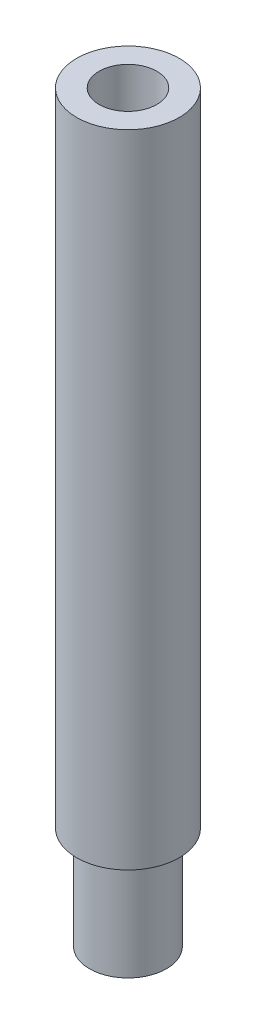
ISO-10303-21;
HEADER;
FILE_DESCRIPTION(('STEP AP214'),'2;1');
FILE_NAME('part.step','',(''),(''),'','','');
FILE_SCHEMA(('AUTOMOTIVE_DESIGN { 1 0 10303 214 1 1 1 1 }'));
ENDSEC;
DATA;
#1=APPLICATION_CONTEXT('core data for automotive mechanical design processes');
#2=APPLICATION_PROTOCOL_DEFINITION('international standard','automotive_design',2000,#1);
#3=PRODUCT_CONTEXT('',#1,'mechanical');
#4=PRODUCT('Part','Part','',(#3));
#5=PRODUCT_RELATED_PRODUCT_CATEGORY('part','',(#4));
#6=PRODUCT_DEFINITION_FORMATION('','',#4);
#7=PRODUCT_DEFINITION_CONTEXT('part definition',#1,'design');
#8=PRODUCT_DEFINITION('design','',#6,#7);
#9=PRODUCT_DEFINITION_SHAPE('','',#8);
#10=(LENGTH_UNIT() NAMED_UNIT(*) SI_UNIT(.MILLI.,.METRE.));
#11=(NAMED_UNIT(*) PLANE_ANGLE_UNIT() SI_UNIT($,.RADIAN.));
#12=(NAMED_UNIT(*) SI_UNIT($,.STERADIAN.) SOLID_ANGLE_UNIT());
#13=UNCERTAINTY_MEASURE_WITH_UNIT(LENGTH_MEASURE(1.E-05),#10,'distance_accuracy_value','');
#14=(GEOMETRIC_REPRESENTATION_CONTEXT(3) GLOBAL_UNCERTAINTY_ASSIGNED_CONTEXT((#13)) GLOBAL_UNIT_ASSIGNED_CONTEXT((#10,
#11,#12)) REPRESENTATION_CONTEXT('',''));
#15=CARTESIAN_POINT('',(0.,0.,0.));
#16=DIRECTION('',(0.,0.,1.));
#17=DIRECTION('',(1.,0.,0.));
#18=AXIS2_PLACEMENT_3D('',#15,#16,#17);
#19=CARTESIAN_POINT('',(0.,0.,0.));
#20=DIRECTION('',(0.,1.,0.));
#21=DIRECTION('',(0.,0.,1.));
#22=AXIS2_PLACEMENT_3D('',#19,#20,#21);
#23=PLANE('',#22);
#24=CARTESIAN_POINT('',(0.,0.,0.));
#25=DIRECTION('',(0.,-1.,0.));
#26=DIRECTION('',(0.,0.,-1.));
#27=AXIS2_PLACEMENT_3D('',#24,#25,#26);
#28=CIRCLE('',#27,3.45439999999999);
#29=CARTESIAN_POINT('',(0.,0.,-3.45439999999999));
#30=VERTEX_POINT('',#29);
#31=EDGE_CURVE('E52',#30,#30,#28,.T.);
#32=ORIENTED_EDGE('',*,*,#31,.F.);
#33=EDGE_LOOP('',(#32));
#34=FACE_BOUND('',#33,.T.);
#35=CARTESIAN_POINT('',(0.,0.,0.));
#36=DIRECTION('',(0.,1.,0.));
#37=DIRECTION('',(0.,0.,1.));
#38=AXIS2_PLACEMENT_3D('',#35,#36,#37);
#39=CIRCLE('',#38,9.525);
#40=CARTESIAN_POINT('',(0.,0.,9.525));
#41=VERTEX_POINT('',#40);
#42=EDGE_CURVE('E11',#41,#41,#39,.T.);
#43=ORIENTED_EDGE('',*,*,#42,.F.);
#44=EDGE_LOOP('',(#43));
#45=FACE_BOUND('',#44,.T.);
#46=ADVANCED_FACE('F32',(#34,#45),#23,.F.);
#47=CARTESIAN_POINT('',(0.,0.,0.));
#48=DIRECTION('',(0.,1.,0.));
#49=DIRECTION('',(0.,0.,1.));
#50=AXIS2_PLACEMENT_3D('',#47,#48,#49);
#51=CYLINDRICAL_SURFACE('',#50,9.525);
#52=CARTESIAN_POINT('',(0.,25.4,0.));
#53=DIRECTION('',(0.,1.,0.));
#54=DIRECTION('',(0.,0.,1.));
#55=AXIS2_PLACEMENT_3D('',#52,#53,#54);
#56=CIRCLE('',#55,9.525);
#57=CARTESIAN_POINT('',(0.,25.4,9.525));
#58=VERTEX_POINT('',#57);
#59=EDGE_CURVE('E38',#58,#58,#56,.T.);
#60=ORIENTED_EDGE('',*,*,#59,.F.);
#61=EDGE_LOOP('',(#60));
#62=FACE_BOUND('',#61,.T.);
#63=ORIENTED_EDGE('',*,*,#42,.T.);
#64=EDGE_LOOP('',(#63));
#65=FACE_BOUND('',#64,.T.);
#66=ADVANCED_FACE('F72',(#62,#65),#51,.T.);
#67=CARTESIAN_POINT('',(9.525,25.4,0.));
#68=DIRECTION('',(0.,1.,0.));
#69=DIRECTION('',(0.,0.,1.));
#70=AXIS2_PLACEMENT_3D('',#67,#68,#69);
#71=PLANE('',#70);
#72=CARTESIAN_POINT('',(0.,25.4,0.));
#73=DIRECTION('',(0.,1.,0.));
#74=DIRECTION('',(0.,0.,1.));
#75=AXIS2_PLACEMENT_3D('',#72,#73,#74);
#76=CIRCLE('',#75,12.7);
#77=CARTESIAN_POINT('',(0.,25.4,12.7));
#78=VERTEX_POINT('',#77);
#79=EDGE_CURVE('E65',#78,#78,#76,.T.);
#80=ORIENTED_EDGE('',*,*,#79,.F.);
#81=EDGE_LOOP('',(#80));
#82=FACE_BOUND('',#81,.T.);
#83=ORIENTED_EDGE('',*,*,#59,.T.);
#84=EDGE_LOOP('',(#83));
#85=FACE_BOUND('',#84,.T.);
#86=ADVANCED_FACE('F70',(#82,#85),#71,.F.);
#87=CARTESIAN_POINT('',(0.,0.,0.));
#88=DIRECTION('',(0.,1.,0.));
#89=DIRECTION('',(0.,0.,1.));
#90=AXIS2_PLACEMENT_3D('',#87,#88,#89);
#91=CYLINDRICAL_SURFACE('',#90,12.7);
#92=CARTESIAN_POINT('',(0.,184.15,0.));
#93=DIRECTION('',(0.,1.,0.));
#94=DIRECTION('',(0.,0.,1.));
#95=AXIS2_PLACEMENT_3D('',#92,#93,#94);
#96=CIRCLE('',#95,12.7);
#97=CARTESIAN_POINT('',(0.,184.15,12.7));
#98=VERTEX_POINT('',#97);
#99=EDGE_CURVE('E62',#98,#98,#96,.T.);
#100=ORIENTED_EDGE('',*,*,#99,.F.);
#101=EDGE_LOOP('',(#100));
#102=FACE_BOUND('',#101,.T.);
#103=ORIENTED_EDGE('',*,*,#79,.T.);
#104=EDGE_LOOP('',(#103));
#105=FACE_BOUND('',#104,.T.);
#106=ADVANCED_FACE('F98',(#102,#105),#91,.T.);
#107=CARTESIAN_POINT('',(12.7,184.15,0.));
#108=DIRECTION('',(0.,-1.,0.));
#109=DIRECTION('',(0.,0.,-1.));
#110=AXIS2_PLACEMENT_3D('',#107,#108,#109);
#111=PLANE('',#110);
#112=CARTESIAN_POINT('',(0.,184.15,0.));
#113=DIRECTION('',(0.,1.,0.));
#114=DIRECTION('',(0.,0.,1.));
#115=AXIS2_PLACEMENT_3D('',#112,#113,#114);
#116=CIRCLE('',#115,7.14374999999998);
#117=CARTESIAN_POINT('',(0.,184.15,7.14374999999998));
#118=VERTEX_POINT('',#117);
#119=EDGE_CURVE('E55',#118,#118,#116,.T.);
#120=ORIENTED_EDGE('',*,*,#119,.F.);
#121=EDGE_LOOP('',(#120));
#122=FACE_BOUND('',#121,.T.);
#123=ORIENTED_EDGE('',*,*,#99,.T.);
#124=EDGE_LOOP('',(#123));
#125=FACE_BOUND('',#124,.T.);
#126=ADVANCED_FACE('F94',(#122,#125),#111,.F.);
#127=CARTESIAN_POINT('',(0.,0.,0.));
#128=DIRECTION('',(0.,1.,0.));
#129=DIRECTION('',(0.,0.,1.));
#130=AXIS2_PLACEMENT_3D('',#127,#128,#129);
#131=CYLINDRICAL_SURFACE('',#130,7.14374999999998);
#132=CARTESIAN_POINT('',(0.,155.575,0.));
#133=DIRECTION('',(0.,1.,0.));
#134=DIRECTION('',(0.,0.,1.));
#135=AXIS2_PLACEMENT_3D('',#132,#133,#134);
#136=CIRCLE('',#135,7.14374999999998);
#137=CARTESIAN_POINT('',(0.,155.575,7.14374999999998));
#138=VERTEX_POINT('',#137);
#139=EDGE_CURVE('E51',#138,#138,#136,.T.);
#140=ORIENTED_EDGE('',*,*,#139,.F.);
#141=EDGE_LOOP('',(#140));
#142=FACE_BOUND('',#141,.T.);
#143=ORIENTED_EDGE('',*,*,#119,.T.);
#144=EDGE_LOOP('',(#143));
#145=FACE_BOUND('',#144,.T.);
#146=ADVANCED_FACE('F90',(#142,#145),#131,.F.);
#147=CARTESIAN_POINT('',(7.14374999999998,155.575,0.));
#148=DIRECTION('',(0.,-1.,0.));
#149=DIRECTION('',(0.,0.,-1.));
#150=AXIS2_PLACEMENT_3D('',#147,#148,#149);
#151=PLANE('',#150);
#152=ORIENTED_EDGE('',*,*,#139,.T.);
#153=EDGE_LOOP('',(#152));
#154=FACE_BOUND('',#153,.T.);
#155=ADVANCED_FACE('F45',(#154),#151,.F.);
#156=CARTESIAN_POINT('',(0.,21.336,0.));
#157=DIRECTION('',(0.,-1.,0.));
#158=DIRECTION('',(0.,0.,-1.));
#159=AXIS2_PLACEMENT_3D('',#156,#157,#158);
#160=CONICAL_SURFACE('',#159,3.45439999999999,1.02974425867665);
#161=CARTESIAN_POINT('',(0.,23.4116129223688,0.));
#162=VERTEX_POINT('',#161);
#163=VERTEX_LOOP('',#162);
#164=FACE_BOUND('',#163,.T.);
#165=CARTESIAN_POINT('',(0.,21.336,0.));
#166=DIRECTION('',(0.,-1.,0.));
#167=DIRECTION('',(0.,0.,-1.));
#168=AXIS2_PLACEMENT_3D('',#165,#166,#167);
#169=CIRCLE('',#168,3.45439999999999);
#170=CARTESIAN_POINT('',(0.,21.336,-3.45439999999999));
#171=VERTEX_POINT('',#170);
#172=EDGE_CURVE('E49',#171,#171,#169,.T.);
#173=ORIENTED_EDGE('',*,*,#172,.T.);
#174=EDGE_LOOP('',(#173));
#175=FACE_BOUND('',#174,.T.);
#176=ADVANCED_FACE('F41',(#164,#175),#160,.F.);
#177=CARTESIAN_POINT('',(0.,0.,0.));
#178=DIRECTION('',(0.,-1.,0.));
#179=DIRECTION('',(0.,0.,-1.));
#180=AXIS2_PLACEMENT_3D('',#177,#178,#179);
#181=CYLINDRICAL_SURFACE('',#180,3.45439999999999);
#182=ORIENTED_EDGE('',*,*,#172,.F.);
#183=EDGE_LOOP('',(#182));
#184=FACE_BOUND('',#183,.T.);
#185=ORIENTED_EDGE('',*,*,#31,.T.);
#186=EDGE_LOOP('',(#185));
#187=FACE_BOUND('',#186,.T.);
#188=ADVANCED_FACE('F44',(#184,#187),#181,.F.);
#189=CLOSED_SHELL('',(#46,#66,#86,#106,#126,#146,#155,#176,#188));
#190=MANIFOLD_SOLID_BREP('B2',#189);
#191=ADVANCED_BREP_SHAPE_REPRESENTATION('',(#18,#190),#14);
#192=SHAPE_DEFINITION_REPRESENTATION(#9,#191);
ENDSEC;
END-ISO-10303-21;
